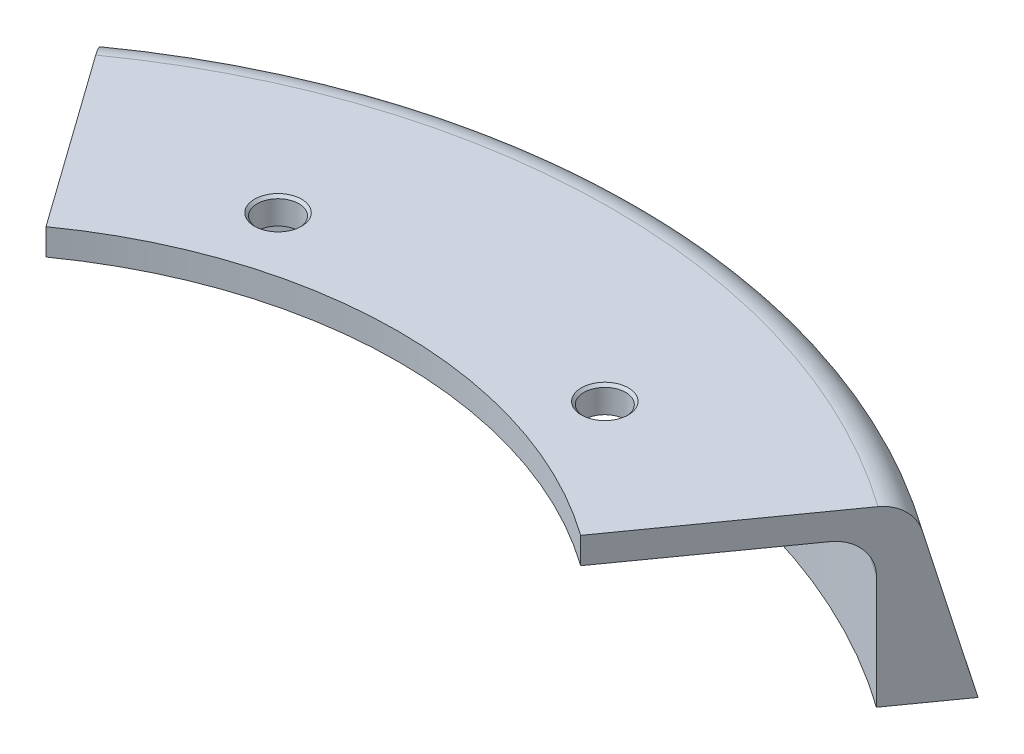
ISO-10303-21;
HEADER;
FILE_DESCRIPTION(('STEP AP214'),'2;1');
FILE_NAME('part.step','',(''),(''),'','','');
FILE_SCHEMA(('AUTOMOTIVE_DESIGN { 1 0 10303 214 1 1 1 1 }'));
ENDSEC;
DATA;
#1=APPLICATION_CONTEXT('core data for automotive mechanical design processes');
#2=APPLICATION_PROTOCOL_DEFINITION('international standard','automotive_design',2000,#1);
#3=PRODUCT_CONTEXT('',#1,'mechanical');
#4=PRODUCT('Part','Part','',(#3));
#5=PRODUCT_RELATED_PRODUCT_CATEGORY('part','',(#4));
#6=PRODUCT_DEFINITION_FORMATION('','',#4);
#7=PRODUCT_DEFINITION_CONTEXT('part definition',#1,'design');
#8=PRODUCT_DEFINITION('design','',#6,#7);
#9=PRODUCT_DEFINITION_SHAPE('','',#8);
#10=(LENGTH_UNIT() NAMED_UNIT(*) SI_UNIT(.MILLI.,.METRE.));
#11=(NAMED_UNIT(*) PLANE_ANGLE_UNIT() SI_UNIT($,.RADIAN.));
#12=(NAMED_UNIT(*) SI_UNIT($,.STERADIAN.) SOLID_ANGLE_UNIT());
#13=UNCERTAINTY_MEASURE_WITH_UNIT(LENGTH_MEASURE(1.E-05),#10,'distance_accuracy_value','');
#14=(GEOMETRIC_REPRESENTATION_CONTEXT(3) GLOBAL_UNCERTAINTY_ASSIGNED_CONTEXT((#13)) GLOBAL_UNIT_ASSIGNED_CONTEXT((#10,
#11,#12)) REPRESENTATION_CONTEXT('',''));
#15=CARTESIAN_POINT('',(0.,0.,0.));
#16=DIRECTION('',(0.,0.,1.));
#17=DIRECTION('',(1.,0.,0.));
#18=AXIS2_PLACEMENT_3D('',#15,#16,#17);
#19=CARTESIAN_POINT('',(0.,-1842.89897738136,-6.43444738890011E-12));
#20=DIRECTION('',(0.,-1.,0.));
#21=DIRECTION('',(0.,0.,-1.));
#22=AXIS2_PLACEMENT_3D('',#19,#20,#21);
#23=CYLINDRICAL_SURFACE('',#22,168.656);
#24=DIRECTION('',(0.,-1.,0.));
#25=VECTOR('',#24,1.);
#26=CARTESIAN_POINT('',(-3.175,-1842.89897738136,-168.626112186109));
#27=LINE('',#26,#25);
#28=CARTESIAN_POINT('',(-3.175,-35.5599999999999,-168.626112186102));
#29=VERTEX_POINT('',#28);
#30=CARTESIAN_POINT('',(-3.175,-18.1845159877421,-168.626112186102));
#31=VERTEX_POINT('',#30);
#32=EDGE_CURVE('E154',#29,#31,#27,.F.);
#33=ORIENTED_EDGE('',*,*,#32,.F.);
#34=CARTESIAN_POINT('',(0.,-35.5600000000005,-1.24157076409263E-13));
#35=DIRECTION('',(0.,-1.,0.));
#36=DIRECTION('',(0.,0.,-1.));
#37=AXIS2_PLACEMENT_3D('',#34,#35,#36);
#38=CIRCLE('',#37,168.656);
#39=CARTESIAN_POINT('',(-92.6999619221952,-35.5600000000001,-140.895576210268));
#40=VERTEX_POINT('',#39);
#41=EDGE_CURVE('E161',#40,#29,#38,.T.);
#42=ORIENTED_EDGE('',*,*,#41,.F.);
#43=DIRECTION('',(0.,-1.,0.));
#44=VECTOR('',#43,1.);
#45=CARTESIAN_POINT('',(-92.6999619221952,6.35000000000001,-140.895576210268));
#46=LINE('',#45,#44);
#47=CARTESIAN_POINT('',(-92.6999619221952,-18.1845159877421,-140.895576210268));
#48=VERTEX_POINT('',#47);
#49=EDGE_CURVE('E174',#48,#40,#46,.T.);
#50=ORIENTED_EDGE('',*,*,#49,.F.);
#51=CARTESIAN_POINT('',(0.,-18.1845159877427,0.));
#52=DIRECTION('',(0.,-1.,0.));
#53=DIRECTION('',(0.,0.,-1.));
#54=AXIS2_PLACEMENT_3D('',#51,#52,#53);
#55=CIRCLE('',#54,168.656);
#56=EDGE_CURVE('E262',#31,#48,#55,.F.);
#57=ORIENTED_EDGE('',*,*,#56,.F.);
#58=EDGE_LOOP('',(#33,#42,#50,#57));
#59=FACE_BOUND('',#58,.T.);
#60=ADVANCED_FACE('F35',(#59),#23,.T.);
#61=CARTESIAN_POINT('',(0.,-37.2035009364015,-1.29895329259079E-13));
#62=DIRECTION('',(0.,-1.,0.));
#63=DIRECTION('',(0.,0.,-1.));
#64=AXIS2_PLACEMENT_3D('',#61,#62,#63);
#65=CONICAL_SURFACE('',#64,173.752121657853,0.261799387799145);
#66=CARTESIAN_POINT('',(-3.175,39.6870430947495,-153.116447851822));
#67=CARTESIAN_POINT('',(-3.175,16.2909519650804,-159.386730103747));
#68=CARTESIAN_POINT('',(-3.175,-7.10516875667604,-165.656901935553));
#69=CARTESIAN_POINT('',(-3.175,-53.8974693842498,-178.197024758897));
#70=CARTESIAN_POINT('',(-3.175,-77.2936492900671,-184.466975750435));
#71=CARTESIAN_POINT('',(-3.175,-100.689858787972,-190.736816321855));
#72=B_SPLINE_CURVE_WITH_KNOTS('',3,(#66,#67,#68,#69,#70,#71),.UNSPECIFIED.,.F.,.F.,(4,2,4),(0.,
72.6652714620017,145.330542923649),.UNSPECIFIED.);
#73=CARTESIAN_POINT('',(-3.175,-35.5600000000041,-173.282662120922));
#74=VERTEX_POINT('',#73);
#75=EDGE_CURVE('E138',#31,#74,#72,.T.);
#76=ORIENTED_EDGE('',*,*,#75,.F.);
#77=ORIENTED_EDGE('',*,*,#56,.T.);
#78=CARTESIAN_POINT('',(-95.4054346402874,-35.5600000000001,-144.68850907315));
#79=CARTESIAN_POINT('',(-94.4826308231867,-29.6333173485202,-143.394785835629));
#80=CARTESIAN_POINT('',(-93.5598096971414,-23.706642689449,-142.101038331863));
#81=CARTESIAN_POINT('',(-91.7141328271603,-11.8533093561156,-139.513494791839));
#82=CARTESIAN_POINT('',(-90.7912770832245,-5.92665068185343,-138.219698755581));
#83=CARTESIAN_POINT('',(-89.8684040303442,0.,-136.925878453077));
#84=B_SPLINE_CURVE_WITH_KNOTS('',3,(#78,#79,#80,#81,#82,#83),.UNSPECIFIED.,.F.,.F.,(4,2,4),(0.,
18.408087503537,36.8161750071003),.UNSPECIFIED.);
#85=CARTESIAN_POINT('',(-95.4054346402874,-35.5600000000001,-144.68850907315));
#86=VERTEX_POINT('',#85);
#87=EDGE_CURVE('E141',#86,#48,#84,.T.);
#88=ORIENTED_EDGE('',*,*,#87,.F.);
#89=CARTESIAN_POINT('',(0.,-35.5600000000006,-1.24157076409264E-13));
#90=DIRECTION('',(0.,-1.,0.));
#91=DIRECTION('',(0.,0.,-1.));
#92=AXIS2_PLACEMENT_3D('',#89,#90,#91);
#93=CIRCLE('',#92,173.311746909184);
#94=EDGE_CURVE('E135',#86,#74,#93,.T.);
#95=ORIENTED_EDGE('',*,*,#94,.T.);
#96=EDGE_LOOP('',(#76,#77,#88,#95));
#97=FACE_BOUND('',#96,.T.);
#98=ADVANCED_FACE('F137',(#97),#65,.F.);
#99=CARTESIAN_POINT('',(-97.9390376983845,6.34999999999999,-137.305466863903));
#100=DIRECTION('',(0.,1.,0.));
#101=DIRECTION('',(0.,0.,1.));
#102=AXIS2_PLACEMENT_3D('',#99,#100,#101);
#103=PLANE('',#102);
#104=DIRECTION('',(-0.580702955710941,0.,0.814115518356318));
#105=VECTOR('',#104,1.);
#106=CARTESIAN_POINT('',(97.9390376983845,6.3499999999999,-137.305466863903));
#107=LINE('',#106,#105);
#108=CARTESIAN_POINT('',(94.402174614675,6.3499999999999,-132.3469676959));
#109=VERTEX_POINT('',#108);
#110=CARTESIAN_POINT('',(64.5306159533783,6.34999999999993,-90.4685869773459));
#111=VERTEX_POINT('',#110);
#112=EDGE_CURVE('E280',#109,#111,#107,.T.);
#113=ORIENTED_EDGE('',*,*,#112,.F.);
#114=CARTESIAN_POINT('',(0.,6.34999999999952,0.));
#115=DIRECTION('',(0.,1.,0.));
#116=DIRECTION('',(0.,0.,1.));
#117=AXIS2_PLACEMENT_3D('',#114,#115,#116);
#118=CIRCLE('',#117,162.565342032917);
#119=CARTESIAN_POINT('',(-94.402174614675,6.3499999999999,-132.3469676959));
#120=VERTEX_POINT('',#119);
#121=EDGE_CURVE('E340',#109,#120,#118,.T.);
#122=ORIENTED_EDGE('',*,*,#121,.T.);
#123=DIRECTION('',(0.580702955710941,0.,0.814115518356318));
#124=VECTOR('',#123,1.);
#125=CARTESIAN_POINT('',(-97.9390376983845,6.3499999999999,-137.305466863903));
#126=LINE('',#125,#124);
#127=CARTESIAN_POINT('',(-64.5306159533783,6.34999999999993,-90.4685869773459));
#128=VERTEX_POINT('',#127);
#129=EDGE_CURVE('E296',#120,#128,#126,.T.);
#130=ORIENTED_EDGE('',*,*,#129,.T.);
#131=CARTESIAN_POINT('',(0.,6.34999999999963,0.));
#132=DIRECTION('',(0.,-1.,0.));
#133=DIRECTION('',(0.,0.,-1.));
#134=AXIS2_PLACEMENT_3D('',#131,#132,#133);
#135=CIRCLE('',#134,111.125);
#136=EDGE_CURVE('E156',#128,#111,#135,.T.);
#137=ORIENTED_EDGE('',*,*,#136,.T.);
#138=EDGE_LOOP('',(#113,#122,#130,#137));
#139=FACE_BOUND('',#138,.T.);
#140=CARTESIAN_POINT('',(39.4413840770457,6.34999999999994,-121.388098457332));
#141=DIRECTION('',(0.,1.,0.));
#142=DIRECTION('',(0.,0.,1.));
#143=AXIS2_PLACEMENT_3D('',#140,#141,#142);
#144=CIRCLE('',#143,5.6769);
#145=CARTESIAN_POINT('',(39.4413840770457,6.34999999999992,-115.711198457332));
#146=VERTEX_POINT('',#145);
#147=EDGE_CURVE('E261',#146,#146,#144,.T.);
#148=ORIENTED_EDGE('',*,*,#147,.F.);
#149=EDGE_LOOP('',(#148));
#150=FACE_BOUND('',#149,.T.);
#151=CARTESIAN_POINT('',(-39.4413840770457,6.34999999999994,-121.388098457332));
#152=DIRECTION('',(0.,1.,0.));
#153=DIRECTION('',(0.,0.,1.));
#154=AXIS2_PLACEMENT_3D('',#151,#152,#153);
#155=CIRCLE('',#154,5.6769);
#156=CARTESIAN_POINT('',(-39.4413840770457,6.34999999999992,-115.711198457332));
#157=VERTEX_POINT('',#156);
#158=EDGE_CURVE('E271',#157,#157,#155,.T.);
#159=ORIENTED_EDGE('',*,*,#158,.F.);
#160=EDGE_LOOP('',(#159));
#161=FACE_BOUND('',#160,.T.);
#162=ADVANCED_FACE('F235',(#139,#150,#161),#103,.T.);
#163=CARTESIAN_POINT('',(0.,-1842.89897738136,-6.43444738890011E-12));
#164=DIRECTION('',(0.,-1.,0.));
#165=DIRECTION('',(0.,0.,-1.));
#166=AXIS2_PLACEMENT_3D('',#163,#164,#165);
#167=CYLINDRICAL_SURFACE('',#166,111.125);
#168=DIRECTION('',(0.,-1.,0.));
#169=VECTOR('',#168,1.);
#170=CARTESIAN_POINT('',(64.5306159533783,6.34999999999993,-90.4685869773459));
#171=LINE('',#170,#169);
#172=CARTESIAN_POINT('',(64.5306159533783,0.,-90.4685869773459));
#173=VERTEX_POINT('',#172);
#174=EDGE_CURVE('E282',#111,#173,#171,.T.);
#175=ORIENTED_EDGE('',*,*,#174,.F.);
#176=ORIENTED_EDGE('',*,*,#136,.F.);
#177=DIRECTION('',(0.,-1.,0.));
#178=VECTOR('',#177,1.);
#179=CARTESIAN_POINT('',(-64.5306159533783,6.34999999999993,-90.4685869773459));
#180=LINE('',#179,#178);
#181=CARTESIAN_POINT('',(-64.5306159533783,0.,-90.4685869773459));
#182=VERTEX_POINT('',#181);
#183=EDGE_CURVE('E298',#128,#182,#180,.T.);
#184=ORIENTED_EDGE('',*,*,#183,.T.);
#185=CARTESIAN_POINT('',(0.,-2.22044604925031E-13,0.));
#186=DIRECTION('',(0.,-1.,0.));
#187=DIRECTION('',(0.,0.,-1.));
#188=AXIS2_PLACEMENT_3D('',#185,#186,#187);
#189=CIRCLE('',#188,111.125);
#190=EDGE_CURVE('E315',#182,#173,#189,.T.);
#191=ORIENTED_EDGE('',*,*,#190,.T.);
#192=EDGE_LOOP('',(#175,#176,#184,#191));
#193=FACE_BOUND('',#192,.T.);
#194=ADVANCED_FACE('F326',(#193),#167,.F.);
#195=CARTESIAN_POINT('',(-64.5306159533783,-1.61470233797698E-13,-90.4685869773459));
#196=DIRECTION('',(0.,-1.,0.));
#197=DIRECTION('',(0.,0.,-1.));
#198=AXIS2_PLACEMENT_3D('',#195,#196,#197);
#199=PLANE('',#198);
#200=DIRECTION('',(-0.580702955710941,0.,-0.814115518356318));
#201=VECTOR('',#200,1.);
#202=CARTESIAN_POINT('',(-64.5306159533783,0.,-90.4685869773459));
#203=LINE('',#202,#201);
#204=CARTESIAN_POINT('',(-89.6422442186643,-1.00187039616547E-13,-125.673791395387));
#205=VERTEX_POINT('',#204);
#206=EDGE_CURVE('E301',#182,#205,#203,.T.);
#207=ORIENTED_EDGE('',*,*,#206,.T.);
#208=CARTESIAN_POINT('',(0.,-4.77048955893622E-13,0.));
#209=DIRECTION('',(0.,-1.,0.));
#210=DIRECTION('',(0.,0.,-1.));
#211=AXIS2_PLACEMENT_3D('',#208,#209,#210);
#212=CIRCLE('',#211,154.3685);
#213=CARTESIAN_POINT('',(89.6422442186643,-1.00187039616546E-13,-125.673791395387));
#214=VERTEX_POINT('',#213);
#215=EDGE_CURVE('E335',#205,#214,#212,.T.);
#216=ORIENTED_EDGE('',*,*,#215,.T.);
#217=DIRECTION('',(0.580702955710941,0.,-0.814115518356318));
#218=VECTOR('',#217,1.);
#219=CARTESIAN_POINT('',(64.5306159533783,0.,-90.4685869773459));
#220=LINE('',#219,#218);
#221=EDGE_CURVE('E285',#173,#214,#220,.T.);
#222=ORIENTED_EDGE('',*,*,#221,.F.);
#223=ORIENTED_EDGE('',*,*,#190,.F.);
#224=EDGE_LOOP('',(#207,#216,#222,#223));
#225=FACE_BOUND('',#224,.T.);
#226=CARTESIAN_POINT('',(39.4413840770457,0.,-121.388098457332));
#227=DIRECTION('',(0.,-1.,0.));
#228=DIRECTION('',(0.,0.,-1.));
#229=AXIS2_PLACEMENT_3D('',#226,#227,#228);
#230=CIRCLE('',#229,5.0419);
#231=CARTESIAN_POINT('',(39.4413840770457,0.,-126.429998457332));
#232=VERTEX_POINT('',#231);
#233=EDGE_CURVE('E268',#232,#232,#230,.T.);
#234=ORIENTED_EDGE('',*,*,#233,.F.);
#235=EDGE_LOOP('',(#234));
#236=FACE_BOUND('',#235,.T.);
#237=CARTESIAN_POINT('',(-39.4413840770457,0.,-121.388098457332));
#238=DIRECTION('',(0.,-1.,0.));
#239=DIRECTION('',(0.,0.,-1.));
#240=AXIS2_PLACEMENT_3D('',#237,#238,#239);
#241=CIRCLE('',#240,5.0419);
#242=CARTESIAN_POINT('',(-39.4413840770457,0.,-126.429998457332));
#243=VERTEX_POINT('',#242);
#244=EDGE_CURVE('E277',#243,#243,#241,.T.);
#245=ORIENTED_EDGE('',*,*,#244,.F.);
#246=EDGE_LOOP('',(#245));
#247=FACE_BOUND('',#246,.T.);
#248=ADVANCED_FACE('F332',(#225,#236,#247),#199,.T.);
#249=CARTESIAN_POINT('',(0.,-1842.89897738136,-6.43444738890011E-12));
#250=DIRECTION('',(0.,-1.,0.));
#251=DIRECTION('',(0.,0.,-1.));
#252=AXIS2_PLACEMENT_3D('',#249,#250,#251);
#253=CYLINDRICAL_SURFACE('',#252,162.306);
#254=DIRECTION('',(0.,-1.,0.));
#255=VECTOR('',#254,1.);
#256=CARTESIAN_POINT('',(94.25157392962,-1.05338573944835E-13,-132.135833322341));
#257=LINE('',#256,#255);
#258=CARTESIAN_POINT('',(94.2515739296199,-7.93749999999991,-132.135833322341));
#259=VERTEX_POINT('',#258);
#260=CARTESIAN_POINT('',(94.2515739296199,-35.5600000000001,-132.135833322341));
#261=VERTEX_POINT('',#260);
#262=EDGE_CURVE('E288',#259,#261,#257,.T.);
#263=ORIENTED_EDGE('',*,*,#262,.F.);
#264=CARTESIAN_POINT('',(0.,-7.93750000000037,0.));
#265=DIRECTION('',(0.,-1.,0.));
#266=DIRECTION('',(0.,0.,-1.));
#267=AXIS2_PLACEMENT_3D('',#264,#265,#266);
#268=CIRCLE('',#267,162.306);
#269=CARTESIAN_POINT('',(-94.25157392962,-7.93749999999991,-132.135833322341));
#270=VERTEX_POINT('',#269);
#271=EDGE_CURVE('E56',#259,#270,#268,.F.);
#272=ORIENTED_EDGE('',*,*,#271,.T.);
#273=DIRECTION('',(0.,-1.,0.));
#274=VECTOR('',#273,1.);
#275=CARTESIAN_POINT('',(-94.25157392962,-1.05338573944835E-13,-132.135833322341));
#276=LINE('',#275,#274);
#277=CARTESIAN_POINT('',(-94.2515739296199,-35.5600000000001,-132.135833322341));
#278=VERTEX_POINT('',#277);
#279=EDGE_CURVE('E303',#270,#278,#276,.T.);
#280=ORIENTED_EDGE('',*,*,#279,.T.);
#281=CARTESIAN_POINT('',(0.,-35.5600000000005,-1.24157076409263E-13));
#282=DIRECTION('',(0.,-1.,0.));
#283=DIRECTION('',(0.,0.,-1.));
#284=AXIS2_PLACEMENT_3D('',#281,#282,#283);
#285=CIRCLE('',#284,162.306);
#286=EDGE_CURVE('E313',#278,#261,#285,.T.);
#287=ORIENTED_EDGE('',*,*,#286,.T.);
#288=EDGE_LOOP('',(#263,#272,#280,#287));
#289=FACE_BOUND('',#288,.T.);
#290=ADVANCED_FACE('F343',(#289),#253,.F.);
#291=CARTESIAN_POINT('',(-94.2515739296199,-35.5600000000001,-132.135833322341));
#292=DIRECTION('',(0.,-1.,0.));
#293=DIRECTION('',(0.,0.,-1.));
#294=AXIS2_PLACEMENT_3D('',#291,#292,#293);
#295=PLANE('',#294);
#296=CARTESIAN_POINT('',(3.175,-35.56,-173.282662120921));
#297=VERTEX_POINT('',#296);
#298=CARTESIAN_POINT('',(95.4054346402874,-35.5600000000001,-144.68850907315));
#299=VERTEX_POINT('',#298);
#300=EDGE_CURVE('E147',#297,#299,#93,.T.);
#301=ORIENTED_EDGE('',*,*,#300,.F.);
#302=DIRECTION('',(0.,0.,-1.));
#303=VECTOR('',#302,1.);
#304=CARTESIAN_POINT('',(3.175,-35.5600000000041,-135.177168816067));
#305=LINE('',#304,#303);
#306=CARTESIAN_POINT('',(3.175,-35.5599999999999,-168.626112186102));
#307=VERTEX_POINT('',#306);
#308=EDGE_CURVE('E162',#307,#297,#305,.T.);
#309=ORIENTED_EDGE('',*,*,#308,.F.);
#310=CARTESIAN_POINT('',(92.6999619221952,-35.5600000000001,-140.895576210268));
#311=VERTEX_POINT('',#310);
#312=EDGE_CURVE('E146',#307,#311,#38,.T.);
#313=ORIENTED_EDGE('',*,*,#312,.T.);
#314=DIRECTION('',(0.580702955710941,0.,-0.814115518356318));
#315=VECTOR('',#314,1.);
#316=CARTESIAN_POINT('',(-5.16963354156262,-35.5600000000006,-3.6874637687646));
#317=LINE('',#316,#315);
#318=EDGE_CURVE('E173',#311,#299,#317,.T.);
#319=ORIENTED_EDGE('',*,*,#318,.T.);
#320=EDGE_LOOP('',(#301,#309,#313,#319));
#321=FACE_BOUND('',#320,.T.);
#322=CARTESIAN_POINT('',(0.,-35.5600000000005,-1.24157076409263E-13));
#323=DIRECTION('',(0.,-1.,0.));
#324=DIRECTION('',(0.,0.,-1.));
#325=AXIS2_PLACEMENT_3D('',#322,#323,#324);
#326=CIRCLE('',#325,179.885750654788);
#327=CARTESIAN_POINT('',(-104.460187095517,-35.5600000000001,-146.447781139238));
#328=VERTEX_POINT('',#327);
#329=CARTESIAN_POINT('',(104.460187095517,-35.5600000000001,-146.447781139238));
#330=VERTEX_POINT('',#329);
#331=EDGE_CURVE('E311',#328,#330,#326,.T.);
#332=ORIENTED_EDGE('',*,*,#331,.T.);
#333=DIRECTION('',(0.580702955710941,0.,-0.814115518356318));
#334=VECTOR('',#333,1.);
#335=CARTESIAN_POINT('',(94.2515739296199,-35.5600000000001,-132.135833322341));
#336=LINE('',#335,#334);
#337=EDGE_CURVE('E290',#261,#330,#336,.T.);
#338=ORIENTED_EDGE('',*,*,#337,.F.);
#339=ORIENTED_EDGE('',*,*,#286,.F.);
#340=DIRECTION('',(-0.580702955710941,0.,-0.814115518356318));
#341=VECTOR('',#340,1.);
#342=CARTESIAN_POINT('',(-94.2515739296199,-35.5600000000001,-132.135833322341));
#343=LINE('',#342,#341);
#344=EDGE_CURVE('E305',#278,#328,#343,.T.);
#345=ORIENTED_EDGE('',*,*,#344,.T.);
#346=EDGE_LOOP('',(#332,#338,#339,#345));
#347=FACE_BOUND('',#346,.T.);
#348=DIRECTION('',(0.,0.,-1.));
#349=VECTOR('',#348,1.);
#350=CARTESIAN_POINT('',(-3.175,-35.5600000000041,-135.177168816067));
#351=LINE('',#350,#349);
#352=EDGE_CURVE('E153',#29,#74,#351,.T.);
#353=ORIENTED_EDGE('',*,*,#352,.T.);
#354=ORIENTED_EDGE('',*,*,#94,.F.);
#355=DIRECTION('',(-0.580702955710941,0.,-0.814115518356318));
#356=VECTOR('',#355,1.);
#357=CARTESIAN_POINT('',(5.16963354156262,-35.5600000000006,-3.6874637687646));
#358=LINE('',#357,#356);
#359=EDGE_CURVE('E176',#40,#86,#358,.T.);
#360=ORIENTED_EDGE('',*,*,#359,.F.);
#361=ORIENTED_EDGE('',*,*,#41,.T.);
#362=EDGE_LOOP('',(#353,#354,#360,#361));
#363=FACE_BOUND('',#362,.T.);
#364=ADVANCED_FACE('F159',(#321,#347,#363),#295,.T.);
#365=CARTESIAN_POINT('',(0.,-35.5600000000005,-1.24157076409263E-13));
#366=DIRECTION('',(0.,-1.,0.));
#367=DIRECTION('',(0.,0.,-1.));
#368=AXIS2_PLACEMENT_3D('',#365,#366,#367);
#369=CONICAL_SURFACE('',#368,179.885750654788,0.261799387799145);
#370=DIRECTION('',(0.150296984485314,0.965925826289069,0.210708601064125));
#371=VECTOR('',#370,1.);
#372=CARTESIAN_POINT('',(-104.460187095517,-35.5600000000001,-146.447781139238));
#373=LINE('',#372,#371);
#374=CARTESIAN_POINT('',(-98.8544452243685,0.466876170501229,-138.588820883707));
#375=VERTEX_POINT('',#374);
#376=EDGE_CURVE('E308',#328,#375,#373,.T.);
#377=ORIENTED_EDGE('',*,*,#376,.T.);
#378=CARTESIAN_POINT('',(0.,0.466876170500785,0.));
#379=DIRECTION('',(0.,1.,0.));
#380=DIRECTION('',(0.,0.,1.));
#381=AXIS2_PLACEMENT_3D('',#378,#379,#380);
#382=CIRCLE('',#381,170.232378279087);
#383=CARTESIAN_POINT('',(98.8544452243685,0.466876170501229,-138.588820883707));
#384=VERTEX_POINT('',#383);
#385=EDGE_CURVE('E527',#375,#384,#382,.F.);
#386=ORIENTED_EDGE('',*,*,#385,.T.);
#387=DIRECTION('',(-0.150296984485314,0.965925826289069,0.210708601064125));
#388=VECTOR('',#387,1.);
#389=CARTESIAN_POINT('',(104.460187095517,-35.5600000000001,-146.447781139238));
#390=LINE('',#389,#388);
#391=EDGE_CURVE('E293',#330,#384,#390,.T.);
#392=ORIENTED_EDGE('',*,*,#391,.F.);
#393=ORIENTED_EDGE('',*,*,#331,.F.);
#394=EDGE_LOOP('',(#377,#386,#392,#393));
#395=FACE_BOUND('',#394,.T.);
#396=ADVANCED_FACE('F363',(#395),#369,.T.);
#397=CARTESIAN_POINT('',(0.,0.,0.));
#398=DIRECTION('',(0.814115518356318,0.,-0.580702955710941));
#399=DIRECTION('',(-0.580702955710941,0.,-0.814115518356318));
#400=AXIS2_PLACEMENT_3D('',#397,#398,#399);
#401=PLANE('',#400);
#402=ORIENTED_EDGE('',*,*,#129,.F.);
#403=CARTESIAN_POINT('',(-94.402174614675,-1.58750000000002,-132.3469676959));
#404=DIRECTION('',(0.814115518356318,0.,-0.580702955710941));
#405=DIRECTION('',(-0.580702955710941,0.,-0.814115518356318));
#406=AXIS2_PLACEMENT_3D('',#403,#404,#405);
#407=CIRCLE('',#406,7.9375);
#408=EDGE_CURVE('E337',#120,#375,#407,.F.);
#409=ORIENTED_EDGE('',*,*,#408,.T.);
#410=ORIENTED_EDGE('',*,*,#376,.F.);
#411=ORIENTED_EDGE('',*,*,#344,.F.);
#412=ORIENTED_EDGE('',*,*,#279,.F.);
#413=CARTESIAN_POINT('',(-89.6422442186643,-7.93749999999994,-125.673791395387));
#414=DIRECTION('',(0.814115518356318,0.,-0.580702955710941));
#415=DIRECTION('',(-0.580702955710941,0.,-0.814115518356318));
#416=AXIS2_PLACEMENT_3D('',#413,#414,#415);
#417=CIRCLE('',#416,7.9375);
#418=EDGE_CURVE('E11',#270,#205,#417,.T.);
#419=ORIENTED_EDGE('',*,*,#418,.T.);
#420=ORIENTED_EDGE('',*,*,#206,.F.);
#421=ORIENTED_EDGE('',*,*,#183,.F.);
#422=EDGE_LOOP('',(#402,#409,#410,#411,#412,#419,#420,#421));
#423=FACE_BOUND('',#422,.T.);
#424=ADVANCED_FACE('F366',(#423),#401,.F.);
#425=CARTESIAN_POINT('',(0.,0.,0.));
#426=DIRECTION('',(0.814115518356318,0.,0.580702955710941));
#427=DIRECTION('',(0.580702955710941,0.,-0.814115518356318));
#428=AXIS2_PLACEMENT_3D('',#425,#426,#427);
#429=PLANE('',#428);
#430=ORIENTED_EDGE('',*,*,#391,.T.);
#431=CARTESIAN_POINT('',(94.402174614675,-1.58750000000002,-132.3469676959));
#432=DIRECTION('',(0.814115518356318,0.,0.580702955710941));
#433=DIRECTION('',(0.580702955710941,0.,-0.814115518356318));
#434=AXIS2_PLACEMENT_3D('',#431,#432,#433);
#435=CIRCLE('',#434,7.9375);
#436=EDGE_CURVE('E528',#384,#109,#435,.T.);
#437=ORIENTED_EDGE('',*,*,#436,.T.);
#438=ORIENTED_EDGE('',*,*,#112,.T.);
#439=ORIENTED_EDGE('',*,*,#174,.T.);
#440=ORIENTED_EDGE('',*,*,#221,.T.);
#441=CARTESIAN_POINT('',(89.6422442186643,-7.93749999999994,-125.673791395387));
#442=DIRECTION('',(0.814115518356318,0.,0.580702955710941));
#443=DIRECTION('',(0.580702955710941,0.,-0.814115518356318));
#444=AXIS2_PLACEMENT_3D('',#441,#442,#443);
#445=CIRCLE('',#444,7.9375);
#446=EDGE_CURVE('E43',#214,#259,#445,.F.);
#447=ORIENTED_EDGE('',*,*,#446,.T.);
#448=ORIENTED_EDGE('',*,*,#262,.T.);
#449=ORIENTED_EDGE('',*,*,#337,.T.);
#450=EDGE_LOOP('',(#430,#437,#438,#439,#440,#447,#448,#449));
#451=FACE_BOUND('',#450,.T.);
#452=ADVANCED_FACE('F329',(#451),#429,.T.);
#453=CARTESIAN_POINT('',(-39.4413840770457,6.34999999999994,-121.388098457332));
#454=DIRECTION('',(0.,1.,0.));
#455=DIRECTION('',(0.,0.,1.));
#456=AXIS2_PLACEMENT_3D('',#453,#454,#455);
#457=CYLINDRICAL_SURFACE('',#456,5.0419);
#458=CARTESIAN_POINT('',(-39.4413840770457,5.71499999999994,-121.388098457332));
#459=DIRECTION('',(0.,1.,0.));
#460=DIRECTION('',(0.,0.,1.));
#461=AXIS2_PLACEMENT_3D('',#458,#459,#460);
#462=CIRCLE('',#461,5.0419);
#463=CARTESIAN_POINT('',(-39.4413840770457,5.71499999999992,-116.346198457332));
#464=VERTEX_POINT('',#463);
#465=EDGE_CURVE('E274',#464,#464,#462,.T.);
#466=ORIENTED_EDGE('',*,*,#465,.T.);
#467=EDGE_LOOP('',(#466));
#468=FACE_BOUND('',#467,.T.);
#469=ORIENTED_EDGE('',*,*,#244,.T.);
#470=EDGE_LOOP('',(#469));
#471=FACE_BOUND('',#470,.T.);
#472=ADVANCED_FACE('F374',(#468,#471),#457,.F.);
#473=CARTESIAN_POINT('',(-39.4413840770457,6.34999999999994,-121.388098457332));
#474=DIRECTION('',(0.,1.,0.));
#475=DIRECTION('',(0.,0.,1.));
#476=AXIS2_PLACEMENT_3D('',#473,#474,#475);
#477=CONICAL_SURFACE('',#476,5.6769,0.785398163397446);
#478=ORIENTED_EDGE('',*,*,#465,.F.);
#479=EDGE_LOOP('',(#478));
#480=FACE_BOUND('',#479,.T.);
#481=ORIENTED_EDGE('',*,*,#158,.T.);
#482=EDGE_LOOP('',(#481));
#483=FACE_BOUND('',#482,.T.);
#484=ADVANCED_FACE('F377',(#480,#483),#477,.F.);
#485=CARTESIAN_POINT('',(39.4413840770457,6.34999999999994,-121.388098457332));
#486=DIRECTION('',(0.,1.,0.));
#487=DIRECTION('',(0.,0.,1.));
#488=AXIS2_PLACEMENT_3D('',#485,#486,#487);
#489=CYLINDRICAL_SURFACE('',#488,5.0419);
#490=CARTESIAN_POINT('',(39.4413840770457,5.71499999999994,-121.388098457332));
#491=DIRECTION('',(0.,1.,0.));
#492=DIRECTION('',(0.,0.,1.));
#493=AXIS2_PLACEMENT_3D('',#490,#491,#492);
#494=CIRCLE('',#493,5.0419);
#495=CARTESIAN_POINT('',(39.4413840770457,5.71499999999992,-116.346198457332));
#496=VERTEX_POINT('',#495);
#497=EDGE_CURVE('E265',#496,#496,#494,.T.);
#498=ORIENTED_EDGE('',*,*,#497,.T.);
#499=EDGE_LOOP('',(#498));
#500=FACE_BOUND('',#499,.T.);
#501=ORIENTED_EDGE('',*,*,#233,.T.);
#502=EDGE_LOOP('',(#501));
#503=FACE_BOUND('',#502,.T.);
#504=ADVANCED_FACE('F243',(#500,#503),#489,.F.);
#505=CARTESIAN_POINT('',(39.4413840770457,6.34999999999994,-121.388098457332));
#506=DIRECTION('',(0.,1.,0.));
#507=DIRECTION('',(0.,0.,1.));
#508=AXIS2_PLACEMENT_3D('',#505,#506,#507);
#509=CONICAL_SURFACE('',#508,5.6769,0.785398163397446);
#510=ORIENTED_EDGE('',*,*,#497,.F.);
#511=EDGE_LOOP('',(#510));
#512=FACE_BOUND('',#511,.T.);
#513=ORIENTED_EDGE('',*,*,#147,.T.);
#514=EDGE_LOOP('',(#513));
#515=FACE_BOUND('',#514,.T.);
#516=ADVANCED_FACE('F238',(#512,#515),#509,.F.);
#517=ORIENTED_EDGE('',*,*,#312,.F.);
#518=DIRECTION('',(0.,-1.,0.));
#519=VECTOR('',#518,1.);
#520=CARTESIAN_POINT('',(3.175,-1842.89897738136,-168.626112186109));
#521=LINE('',#520,#519);
#522=CARTESIAN_POINT('',(3.175,-18.1845159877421,-168.626112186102));
#523=VERTEX_POINT('',#522);
#524=EDGE_CURVE('E168',#307,#523,#521,.F.);
#525=ORIENTED_EDGE('',*,*,#524,.T.);
#526=CARTESIAN_POINT('',(92.6999619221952,-18.1845159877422,-140.895576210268));
#527=VERTEX_POINT('',#526);
#528=EDGE_CURVE('E259',#527,#523,#55,.F.);
#529=ORIENTED_EDGE('',*,*,#528,.F.);
#530=DIRECTION('',(0.,-1.,0.));
#531=VECTOR('',#530,1.);
#532=CARTESIAN_POINT('',(92.6999619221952,6.35000000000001,-140.895576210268));
#533=LINE('',#532,#531);
#534=EDGE_CURVE('E170',#527,#311,#533,.T.);
#535=ORIENTED_EDGE('',*,*,#534,.T.);
#536=EDGE_LOOP('',(#517,#525,#529,#535));
#537=FACE_BOUND('',#536,.T.);
#538=ADVANCED_FACE('F197',(#537),#23,.T.);
#539=ORIENTED_EDGE('',*,*,#528,.T.);
#540=CARTESIAN_POINT('',(3.175,39.6870430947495,-153.116447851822));
#541=CARTESIAN_POINT('',(3.175,16.2909519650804,-159.386730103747));
#542=CARTESIAN_POINT('',(3.175,-7.10516875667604,-165.656901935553));
#543=CARTESIAN_POINT('',(3.175,-53.8974693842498,-178.197024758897));
#544=CARTESIAN_POINT('',(3.175,-77.2936492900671,-184.466975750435));
#545=CARTESIAN_POINT('',(3.175,-100.689858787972,-190.736816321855));
#546=B_SPLINE_CURVE_WITH_KNOTS('',3,(#540,#541,#542,#543,#544,#545),.UNSPECIFIED.,.F.,.F.,(4,2,
4),(0.,72.6652714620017,145.330542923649),.UNSPECIFIED.);
#547=EDGE_CURVE('E155',#523,#297,#546,.T.);
#548=ORIENTED_EDGE('',*,*,#547,.T.);
#549=ORIENTED_EDGE('',*,*,#300,.T.);
#550=CARTESIAN_POINT('',(95.4054346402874,-35.5600000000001,-144.68850907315));
#551=CARTESIAN_POINT('',(94.4826308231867,-29.6333173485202,-143.394785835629));
#552=CARTESIAN_POINT('',(93.5598096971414,-23.706642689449,-142.101038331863));
#553=CARTESIAN_POINT('',(91.7141328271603,-11.8533093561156,-139.513494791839));
#554=CARTESIAN_POINT('',(90.7912770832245,-5.92665068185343,-138.219698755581));
#555=CARTESIAN_POINT('',(89.8684040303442,0.,-136.925878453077));
#556=B_SPLINE_CURVE_WITH_KNOTS('',3,(#550,#551,#552,#553,#554,#555),.UNSPECIFIED.,.F.,.F.,(4,2,
4),(0.,18.408087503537,36.8161750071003),.UNSPECIFIED.);
#557=EDGE_CURVE('E177',#299,#527,#556,.T.);
#558=ORIENTED_EDGE('',*,*,#557,.T.);
#559=EDGE_LOOP('',(#539,#548,#549,#558));
#560=FACE_BOUND('',#559,.T.);
#561=ADVANCED_FACE('F194',(#560),#65,.F.);
#562=CARTESIAN_POINT('',(5.16963354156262,0.,-3.68746376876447));
#563=DIRECTION('',(0.814115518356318,0.,-0.580702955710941));
#564=DIRECTION('',(-0.580702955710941,0.,-0.814115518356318));
#565=AXIS2_PLACEMENT_3D('',#562,#563,#564);
#566=PLANE('',#565);
#567=ORIENTED_EDGE('',*,*,#49,.T.);
#568=ORIENTED_EDGE('',*,*,#359,.T.);
#569=ORIENTED_EDGE('',*,*,#87,.T.);
#570=EDGE_LOOP('',(#567,#568,#569));
#571=FACE_BOUND('',#570,.T.);
#572=ADVANCED_FACE('F191',(#571),#566,.T.);
#573=CARTESIAN_POINT('',(-5.16963354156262,0.,-3.68746376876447));
#574=DIRECTION('',(0.814115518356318,0.,0.580702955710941));
#575=DIRECTION('',(0.580702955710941,0.,-0.814115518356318));
#576=AXIS2_PLACEMENT_3D('',#573,#574,#575);
#577=PLANE('',#576);
#578=ORIENTED_EDGE('',*,*,#557,.F.);
#579=ORIENTED_EDGE('',*,*,#318,.F.);
#580=ORIENTED_EDGE('',*,*,#534,.F.);
#581=EDGE_LOOP('',(#578,#579,#580));
#582=FACE_BOUND('',#581,.T.);
#583=ADVANCED_FACE('F199',(#582),#577,.F.);
#584=CARTESIAN_POINT('',(3.175,-14.6050000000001,-135.177168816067));
#585=DIRECTION('',(1.,0.,0.));
#586=DIRECTION('',(0.,0.,-1.));
#587=AXIS2_PLACEMENT_3D('',#584,#585,#586);
#588=PLANE('',#587);
#589=ORIENTED_EDGE('',*,*,#524,.F.);
#590=ORIENTED_EDGE('',*,*,#308,.T.);
#591=ORIENTED_EDGE('',*,*,#547,.F.);
#592=EDGE_LOOP('',(#589,#590,#591));
#593=FACE_BOUND('',#592,.T.);
#594=ADVANCED_FACE('F221',(#593),#588,.T.);
#595=CARTESIAN_POINT('',(-3.175,-14.6050000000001,-135.177168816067));
#596=DIRECTION('',(1.,0.,0.));
#597=DIRECTION('',(0.,0.,-1.));
#598=AXIS2_PLACEMENT_3D('',#595,#596,#597);
#599=PLANE('',#598);
#600=ORIENTED_EDGE('',*,*,#352,.F.);
#601=ORIENTED_EDGE('',*,*,#32,.T.);
#602=ORIENTED_EDGE('',*,*,#75,.T.);
#603=EDGE_LOOP('',(#600,#601,#602));
#604=FACE_BOUND('',#603,.T.);
#605=ADVANCED_FACE('F152',(#604),#599,.F.);
#606=CARTESIAN_POINT('',(0.,-1.58750000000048,0.));
#607=DIRECTION('',(0.,1.,0.));
#608=DIRECTION('',(0.,0.,1.));
#609=AXIS2_PLACEMENT_3D('',#606,#607,#608);
#610=TOROIDAL_SURFACE('',#609,162.565342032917,7.9375);
#611=ORIENTED_EDGE('',*,*,#408,.F.);
#612=ORIENTED_EDGE('',*,*,#121,.F.);
#613=ORIENTED_EDGE('',*,*,#436,.F.);
#614=ORIENTED_EDGE('',*,*,#385,.F.);
#615=EDGE_LOOP('',(#611,#612,#613,#614));
#616=FACE_BOUND('',#615,.T.);
#617=ADVANCED_FACE('F220',(#616),#610,.T.);
#618=CARTESIAN_POINT('',(0.,-7.93750000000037,0.));
#619=DIRECTION('',(0.,-1.,0.));
#620=DIRECTION('',(0.,0.,-1.));
#621=AXIS2_PLACEMENT_3D('',#618,#619,#620);
#622=TOROIDAL_SURFACE('',#621,154.3685,7.9375);
#623=ORIENTED_EDGE('',*,*,#418,.F.);
#624=ORIENTED_EDGE('',*,*,#271,.F.);
#625=ORIENTED_EDGE('',*,*,#446,.F.);
#626=ORIENTED_EDGE('',*,*,#215,.F.);
#627=EDGE_LOOP('',(#623,#624,#625,#626));
#628=FACE_BOUND('',#627,.T.);
#629=ADVANCED_FACE('F37',(#628),#622,.F.);
#630=CLOSED_SHELL('',(#60,#98,#162,#194,#248,#290,#364,#396,#424,#452,#472,#484,#504,#516,#538,
#561,#572,#583,#594,#605,#617,#629));
#631=MANIFOLD_SOLID_BREP('B2',#630);
#632=ADVANCED_BREP_SHAPE_REPRESENTATION('',(#18,#631),#14);
#633=SHAPE_DEFINITION_REPRESENTATION(#9,#632);
ENDSEC;
END-ISO-10303-21;
